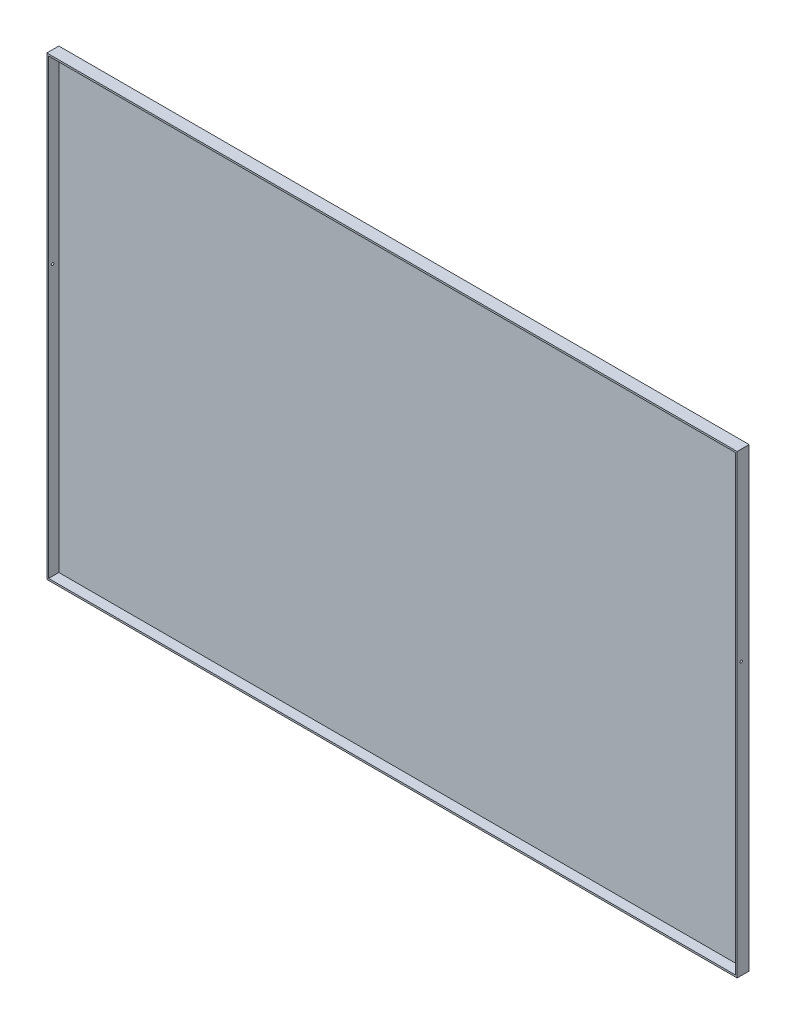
ISO-10303-21;
HEADER;
FILE_DESCRIPTION(('STEP AP214'),'2;1');
FILE_NAME('part.step','',(''),(''),'','','');
FILE_SCHEMA(('AUTOMOTIVE_DESIGN { 1 0 10303 214 1 1 1 1 }'));
ENDSEC;
DATA;
#1=APPLICATION_CONTEXT('core data for automotive mechanical design processes');
#2=APPLICATION_PROTOCOL_DEFINITION('international standard','automotive_design',2000,#1);
#3=PRODUCT_CONTEXT('',#1,'mechanical');
#4=PRODUCT('Part','Part','',(#3));
#5=PRODUCT_RELATED_PRODUCT_CATEGORY('part','',(#4));
#6=PRODUCT_DEFINITION_FORMATION('','',#4);
#7=PRODUCT_DEFINITION_CONTEXT('part definition',#1,'design');
#8=PRODUCT_DEFINITION('design','',#6,#7);
#9=PRODUCT_DEFINITION_SHAPE('','',#8);
#10=(LENGTH_UNIT() NAMED_UNIT(*) SI_UNIT(.MILLI.,.METRE.));
#11=(NAMED_UNIT(*) PLANE_ANGLE_UNIT() SI_UNIT($,.RADIAN.));
#12=(NAMED_UNIT(*) SI_UNIT($,.STERADIAN.) SOLID_ANGLE_UNIT());
#13=UNCERTAINTY_MEASURE_WITH_UNIT(LENGTH_MEASURE(1.E-05),#10,'distance_accuracy_value','');
#14=(GEOMETRIC_REPRESENTATION_CONTEXT(3) GLOBAL_UNCERTAINTY_ASSIGNED_CONTEXT((#13)) GLOBAL_UNIT_ASSIGNED_CONTEXT((#10,
#11,#12)) REPRESENTATION_CONTEXT('',''));
#15=CARTESIAN_POINT('',(0.,0.,0.));
#16=DIRECTION('',(0.,0.,1.));
#17=DIRECTION('',(1.,0.,0.));
#18=AXIS2_PLACEMENT_3D('',#15,#16,#17);
#19=CARTESIAN_POINT('',(-863.,-570.,30.));
#20=DIRECTION('',(1.,0.,0.));
#21=DIRECTION('',(0.,0.,-1.));
#22=AXIS2_PLACEMENT_3D('',#19,#20,#21);
#23=PLANE('',#22);
#24=CARTESIAN_POINT('',(-863.,110.,20.));
#25=DIRECTION('',(-1.,0.,0.));
#26=DIRECTION('',(0.,0.,1.));
#27=AXIS2_PLACEMENT_3D('',#24,#25,#26);
#28=CIRCLE('',#27,3.);
#29=CARTESIAN_POINT('',(-863.,110.,23.));
#30=VERTEX_POINT('',#29);
#31=EDGE_CURVE('E192',#30,#30,#28,.T.);
#32=ORIENTED_EDGE('',*,*,#31,.F.);
#33=EDGE_LOOP('',(#32));
#34=FACE_BOUND('',#33,.T.);
#35=DIRECTION('',(0.,-1.,0.));
#36=VECTOR('',#35,1.);
#37=CARTESIAN_POINT('',(-863.,-570.,0.));
#38=LINE('',#37,#36);
#39=CARTESIAN_POINT('',(-863.,570.,0.));
#40=VERTEX_POINT('',#39);
#41=CARTESIAN_POINT('',(-863.,-570.,0.));
#42=VERTEX_POINT('',#41);
#43=EDGE_CURVE('E148',#40,#42,#38,.T.);
#44=ORIENTED_EDGE('',*,*,#43,.T.);
#45=DIRECTION('',(0.,0.,-1.));
#46=VECTOR('',#45,1.);
#47=CARTESIAN_POINT('',(-863.,-570.,30.));
#48=LINE('',#47,#46);
#49=CARTESIAN_POINT('',(-863.,-570.,30.));
#50=VERTEX_POINT('',#49);
#51=EDGE_CURVE('E11',#50,#42,#48,.T.);
#52=ORIENTED_EDGE('',*,*,#51,.F.);
#53=DIRECTION('',(0.,-1.,0.));
#54=VECTOR('',#53,1.);
#55=CARTESIAN_POINT('',(-863.,-570.,30.));
#56=LINE('',#55,#54);
#57=CARTESIAN_POINT('',(-863.,570.,30.));
#58=VERTEX_POINT('',#57);
#59=EDGE_CURVE('E141',#58,#50,#56,.T.);
#60=ORIENTED_EDGE('',*,*,#59,.F.);
#61=DIRECTION('',(0.,0.,-1.));
#62=VECTOR('',#61,1.);
#63=CARTESIAN_POINT('',(-863.,570.,30.));
#64=LINE('',#63,#62);
#65=EDGE_CURVE('E147',#58,#40,#64,.T.);
#66=ORIENTED_EDGE('',*,*,#65,.T.);
#67=EDGE_LOOP('',(#44,#52,#60,#66));
#68=FACE_BOUND('',#67,.T.);
#69=ADVANCED_FACE('F33',(#34,#68),#23,.F.);
#70=CARTESIAN_POINT('',(863.,-570.,30.));
#71=DIRECTION('',(0.,1.,0.));
#72=DIRECTION('',(-1.,0.,0.));
#73=AXIS2_PLACEMENT_3D('',#70,#71,#72);
#74=PLANE('',#73);
#75=DIRECTION('',(1.,0.,0.));
#76=VECTOR('',#75,1.);
#77=CARTESIAN_POINT('',(863.,-570.,0.));
#78=LINE('',#77,#76);
#79=CARTESIAN_POINT('',(863.,-570.,0.));
#80=VERTEX_POINT('',#79);
#81=EDGE_CURVE('E151',#42,#80,#78,.T.);
#82=ORIENTED_EDGE('',*,*,#81,.T.);
#83=DIRECTION('',(0.,0.,-1.));
#84=VECTOR('',#83,1.);
#85=CARTESIAN_POINT('',(863.,-570.,30.));
#86=LINE('',#85,#84);
#87=CARTESIAN_POINT('',(863.,-570.,30.));
#88=VERTEX_POINT('',#87);
#89=EDGE_CURVE('E41',#88,#80,#86,.T.);
#90=ORIENTED_EDGE('',*,*,#89,.F.);
#91=DIRECTION('',(1.,0.,0.));
#92=VECTOR('',#91,1.);
#93=CARTESIAN_POINT('',(863.,-570.,30.));
#94=LINE('',#93,#92);
#95=EDGE_CURVE('E85',#50,#88,#94,.T.);
#96=ORIENTED_EDGE('',*,*,#95,.F.);
#97=ORIENTED_EDGE('',*,*,#51,.T.);
#98=EDGE_LOOP('',(#82,#90,#96,#97));
#99=FACE_BOUND('',#98,.T.);
#100=ADVANCED_FACE('F181',(#99),#74,.F.);
#101=CARTESIAN_POINT('',(863.,-570.,30.));
#102=DIRECTION('',(-1.,0.,0.));
#103=DIRECTION('',(0.,0.,1.));
#104=AXIS2_PLACEMENT_3D('',#101,#102,#103);
#105=PLANE('',#104);
#106=CARTESIAN_POINT('',(863.,110.,20.));
#107=DIRECTION('',(-1.,0.,0.));
#108=DIRECTION('',(0.,0.,1.));
#109=AXIS2_PLACEMENT_3D('',#106,#107,#108);
#110=CIRCLE('',#109,3.);
#111=CARTESIAN_POINT('',(863.,110.,23.));
#112=VERTEX_POINT('',#111);
#113=EDGE_CURVE('E194',#112,#112,#110,.T.);
#114=ORIENTED_EDGE('',*,*,#113,.T.);
#115=EDGE_LOOP('',(#114));
#116=FACE_BOUND('',#115,.T.);
#117=DIRECTION('',(0.,1.,0.));
#118=VECTOR('',#117,1.);
#119=CARTESIAN_POINT('',(863.,-570.,0.));
#120=LINE('',#119,#118);
#121=CARTESIAN_POINT('',(863.,570.,0.));
#122=VERTEX_POINT('',#121);
#123=EDGE_CURVE('E153',#80,#122,#120,.T.);
#124=ORIENTED_EDGE('',*,*,#123,.T.);
#125=DIRECTION('',(0.,0.,-1.));
#126=VECTOR('',#125,1.);
#127=CARTESIAN_POINT('',(863.,570.,30.));
#128=LINE('',#127,#126);
#129=CARTESIAN_POINT('',(863.,570.,30.));
#130=VERTEX_POINT('',#129);
#131=EDGE_CURVE('E157',#130,#122,#128,.T.);
#132=ORIENTED_EDGE('',*,*,#131,.F.);
#133=DIRECTION('',(0.,1.,0.));
#134=VECTOR('',#133,1.);
#135=CARTESIAN_POINT('',(863.,-570.,30.));
#136=LINE('',#135,#134);
#137=EDGE_CURVE('E144',#88,#130,#136,.T.);
#138=ORIENTED_EDGE('',*,*,#137,.F.);
#139=ORIENTED_EDGE('',*,*,#89,.T.);
#140=EDGE_LOOP('',(#124,#132,#138,#139));
#141=FACE_BOUND('',#140,.T.);
#142=ADVANCED_FACE('F163',(#116,#141),#105,.F.);
#143=CARTESIAN_POINT('',(863.,570.,30.));
#144=DIRECTION('',(0.,-1.,0.));
#145=DIRECTION('',(1.,0.,0.));
#146=AXIS2_PLACEMENT_3D('',#143,#144,#145);
#147=PLANE('',#146);
#148=DIRECTION('',(-1.,0.,0.));
#149=VECTOR('',#148,1.);
#150=CARTESIAN_POINT('',(863.,570.,0.));
#151=LINE('',#150,#149);
#152=EDGE_CURVE('E78',#122,#40,#151,.T.);
#153=ORIENTED_EDGE('',*,*,#152,.T.);
#154=ORIENTED_EDGE('',*,*,#65,.F.);
#155=DIRECTION('',(-1.,0.,0.));
#156=VECTOR('',#155,1.);
#157=CARTESIAN_POINT('',(863.,570.,30.));
#158=LINE('',#157,#156);
#159=EDGE_CURVE('E57',#130,#58,#158,.T.);
#160=ORIENTED_EDGE('',*,*,#159,.F.);
#161=ORIENTED_EDGE('',*,*,#131,.T.);
#162=EDGE_LOOP('',(#153,#154,#160,#161));
#163=FACE_BOUND('',#162,.T.);
#164=ADVANCED_FACE('F171',(#163),#147,.F.);
#165=CARTESIAN_POINT('',(0.,0.,30.));
#166=DIRECTION('',(0.,0.,1.));
#167=DIRECTION('',(1.,0.,0.));
#168=AXIS2_PLACEMENT_3D('',#165,#166,#167);
#169=PLANE('',#168);
#170=DIRECTION('',(0.,-1.,0.));
#171=VECTOR('',#170,1.);
#172=CARTESIAN_POINT('',(-858.6,-570.,30.));
#173=LINE('',#172,#171);
#174=CARTESIAN_POINT('',(-858.6,565.6,30.));
#175=VERTEX_POINT('',#174);
#176=CARTESIAN_POINT('',(-858.6,-565.6,30.));
#177=VERTEX_POINT('',#176);
#178=EDGE_CURVE('E130',#175,#177,#173,.T.);
#179=ORIENTED_EDGE('',*,*,#178,.F.);
#180=DIRECTION('',(-1.,0.,0.));
#181=VECTOR('',#180,1.);
#182=CARTESIAN_POINT('',(863.,565.6,30.));
#183=LINE('',#182,#181);
#184=CARTESIAN_POINT('',(858.6,565.6,30.));
#185=VERTEX_POINT('',#184);
#186=EDGE_CURVE('E139',#185,#175,#183,.T.);
#187=ORIENTED_EDGE('',*,*,#186,.F.);
#188=DIRECTION('',(0.,1.,0.));
#189=VECTOR('',#188,1.);
#190=CARTESIAN_POINT('',(858.6,-570.,30.));
#191=LINE('',#190,#189);
#192=CARTESIAN_POINT('',(858.6,-565.6,30.));
#193=VERTEX_POINT('',#192);
#194=EDGE_CURVE('E137',#193,#185,#191,.T.);
#195=ORIENTED_EDGE('',*,*,#194,.F.);
#196=DIRECTION('',(1.,0.,0.));
#197=VECTOR('',#196,1.);
#198=CARTESIAN_POINT('',(863.,-565.6,30.));
#199=LINE('',#198,#197);
#200=EDGE_CURVE('E122',#177,#193,#199,.T.);
#201=ORIENTED_EDGE('',*,*,#200,.F.);
#202=EDGE_LOOP('',(#179,#187,#195,#201));
#203=FACE_BOUND('',#202,.T.);
#204=ORIENTED_EDGE('',*,*,#59,.T.);
#205=ORIENTED_EDGE('',*,*,#95,.T.);
#206=ORIENTED_EDGE('',*,*,#137,.T.);
#207=ORIENTED_EDGE('',*,*,#159,.T.);
#208=EDGE_LOOP('',(#204,#205,#206,#207));
#209=FACE_BOUND('',#208,.T.);
#210=ADVANCED_FACE('F173',(#203,#209),#169,.T.);
#211=CARTESIAN_POINT('',(0.,0.,0.));
#212=DIRECTION('',(0.,0.,1.));
#213=DIRECTION('',(1.,0.,0.));
#214=AXIS2_PLACEMENT_3D('',#211,#212,#213);
#215=PLANE('',#214);
#216=ORIENTED_EDGE('',*,*,#43,.F.);
#217=ORIENTED_EDGE('',*,*,#152,.F.);
#218=ORIENTED_EDGE('',*,*,#123,.F.);
#219=ORIENTED_EDGE('',*,*,#81,.F.);
#220=EDGE_LOOP('',(#216,#217,#218,#219));
#221=FACE_BOUND('',#220,.T.);
#222=ADVANCED_FACE('F167',(#221),#215,.F.);
#223=CARTESIAN_POINT('',(-858.6,-570.,30.));
#224=DIRECTION('',(1.,0.,0.));
#225=DIRECTION('',(0.,0.,-1.));
#226=AXIS2_PLACEMENT_3D('',#223,#224,#225);
#227=PLANE('',#226);
#228=CARTESIAN_POINT('',(-858.6,110.,20.));
#229=DIRECTION('',(1.,0.,0.));
#230=DIRECTION('',(0.,0.,-1.));
#231=AXIS2_PLACEMENT_3D('',#228,#229,#230);
#232=CIRCLE('',#231,3.);
#233=CARTESIAN_POINT('',(-858.6,110.,17.));
#234=VERTEX_POINT('',#233);
#235=EDGE_CURVE('E199',#234,#234,#232,.T.);
#236=ORIENTED_EDGE('',*,*,#235,.F.);
#237=EDGE_LOOP('',(#236));
#238=FACE_BOUND('',#237,.T.);
#239=DIRECTION('',(0.,-1.,0.));
#240=VECTOR('',#239,1.);
#241=CARTESIAN_POINT('',(-858.6,-570.,4.4));
#242=LINE('',#241,#240);
#243=CARTESIAN_POINT('',(-858.6,565.6,4.4));
#244=VERTEX_POINT('',#243);
#245=CARTESIAN_POINT('',(-858.6,-565.6,4.4));
#246=VERTEX_POINT('',#245);
#247=EDGE_CURVE('E113',#244,#246,#242,.T.);
#248=ORIENTED_EDGE('',*,*,#247,.F.);
#249=DIRECTION('',(0.,0.,-1.));
#250=VECTOR('',#249,1.);
#251=CARTESIAN_POINT('',(-858.6,565.6,30.));
#252=LINE('',#251,#250);
#253=EDGE_CURVE('E133',#175,#244,#252,.T.);
#254=ORIENTED_EDGE('',*,*,#253,.F.);
#255=ORIENTED_EDGE('',*,*,#178,.T.);
#256=DIRECTION('',(0.,0.,-1.));
#257=VECTOR('',#256,1.);
#258=CARTESIAN_POINT('',(-858.6,-565.6,30.));
#259=LINE('',#258,#257);
#260=EDGE_CURVE('E125',#177,#246,#259,.T.);
#261=ORIENTED_EDGE('',*,*,#260,.T.);
#262=EDGE_LOOP('',(#248,#254,#255,#261));
#263=FACE_BOUND('',#262,.T.);
#264=ADVANCED_FACE('F210',(#238,#263),#227,.T.);
#265=CARTESIAN_POINT('',(863.,-565.6,30.));
#266=DIRECTION('',(0.,1.,0.));
#267=DIRECTION('',(-1.,0.,0.));
#268=AXIS2_PLACEMENT_3D('',#265,#266,#267);
#269=PLANE('',#268);
#270=DIRECTION('',(1.,0.,0.));
#271=VECTOR('',#270,1.);
#272=CARTESIAN_POINT('',(863.,-565.6,4.4));
#273=LINE('',#272,#271);
#274=CARTESIAN_POINT('',(858.6,-565.6,4.4));
#275=VERTEX_POINT('',#274);
#276=EDGE_CURVE('E107',#246,#275,#273,.T.);
#277=ORIENTED_EDGE('',*,*,#276,.F.);
#278=ORIENTED_EDGE('',*,*,#260,.F.);
#279=ORIENTED_EDGE('',*,*,#200,.T.);
#280=DIRECTION('',(0.,0.,-1.));
#281=VECTOR('',#280,1.);
#282=CARTESIAN_POINT('',(858.6,-565.6,30.));
#283=LINE('',#282,#281);
#284=EDGE_CURVE('E119',#193,#275,#283,.T.);
#285=ORIENTED_EDGE('',*,*,#284,.T.);
#286=EDGE_LOOP('',(#277,#278,#279,#285));
#287=FACE_BOUND('',#286,.T.);
#288=ADVANCED_FACE('F120',(#287),#269,.T.);
#289=CARTESIAN_POINT('',(858.6,-570.,30.));
#290=DIRECTION('',(-1.,0.,0.));
#291=DIRECTION('',(0.,0.,1.));
#292=AXIS2_PLACEMENT_3D('',#289,#290,#291);
#293=PLANE('',#292);
#294=CARTESIAN_POINT('',(858.6,110.,20.));
#295=DIRECTION('',(-1.,0.,0.));
#296=DIRECTION('',(0.,0.,1.));
#297=AXIS2_PLACEMENT_3D('',#294,#295,#296);
#298=CIRCLE('',#297,3.);
#299=CARTESIAN_POINT('',(858.6,110.,23.));
#300=VERTEX_POINT('',#299);
#301=EDGE_CURVE('E36',#300,#300,#298,.T.);
#302=ORIENTED_EDGE('',*,*,#301,.F.);
#303=EDGE_LOOP('',(#302));
#304=FACE_BOUND('',#303,.T.);
#305=DIRECTION('',(0.,1.,0.));
#306=VECTOR('',#305,1.);
#307=CARTESIAN_POINT('',(858.6,-570.,4.4));
#308=LINE('',#307,#306);
#309=CARTESIAN_POINT('',(858.6,565.6,4.4));
#310=VERTEX_POINT('',#309);
#311=EDGE_CURVE('E111',#275,#310,#308,.T.);
#312=ORIENTED_EDGE('',*,*,#311,.F.);
#313=ORIENTED_EDGE('',*,*,#284,.F.);
#314=ORIENTED_EDGE('',*,*,#194,.T.);
#315=DIRECTION('',(0.,0.,-1.));
#316=VECTOR('',#315,1.);
#317=CARTESIAN_POINT('',(858.6,565.6,30.));
#318=LINE('',#317,#316);
#319=EDGE_CURVE('E48',#185,#310,#318,.T.);
#320=ORIENTED_EDGE('',*,*,#319,.T.);
#321=EDGE_LOOP('',(#312,#313,#314,#320));
#322=FACE_BOUND('',#321,.T.);
#323=ADVANCED_FACE('F127',(#304,#322),#293,.T.);
#324=CARTESIAN_POINT('',(863.,565.6,30.));
#325=DIRECTION('',(0.,-1.,0.));
#326=DIRECTION('',(1.,0.,0.));
#327=AXIS2_PLACEMENT_3D('',#324,#325,#326);
#328=PLANE('',#327);
#329=DIRECTION('',(-1.,0.,0.));
#330=VECTOR('',#329,1.);
#331=CARTESIAN_POINT('',(863.,565.6,4.4));
#332=LINE('',#331,#330);
#333=EDGE_CURVE('E128',#310,#244,#332,.T.);
#334=ORIENTED_EDGE('',*,*,#333,.F.);
#335=ORIENTED_EDGE('',*,*,#319,.F.);
#336=ORIENTED_EDGE('',*,*,#186,.T.);
#337=ORIENTED_EDGE('',*,*,#253,.T.);
#338=EDGE_LOOP('',(#334,#335,#336,#337));
#339=FACE_BOUND('',#338,.T.);
#340=ADVANCED_FACE('F206',(#339),#328,.T.);
#341=CARTESIAN_POINT('',(0.,0.,4.4));
#342=DIRECTION('',(0.,0.,1.));
#343=DIRECTION('',(1.,0.,0.));
#344=AXIS2_PLACEMENT_3D('',#341,#342,#343);
#345=PLANE('',#344);
#346=ORIENTED_EDGE('',*,*,#247,.T.);
#347=ORIENTED_EDGE('',*,*,#276,.T.);
#348=ORIENTED_EDGE('',*,*,#311,.T.);
#349=ORIENTED_EDGE('',*,*,#333,.T.);
#350=EDGE_LOOP('',(#346,#347,#348,#349));
#351=FACE_BOUND('',#350,.T.);
#352=ADVANCED_FACE('F109',(#351),#345,.T.);
#353=CARTESIAN_POINT('',(863.,110.,20.));
#354=DIRECTION('',(-1.,0.,0.));
#355=DIRECTION('',(0.,0.,1.));
#356=AXIS2_PLACEMENT_3D('',#353,#354,#355);
#357=CYLINDRICAL_SURFACE('',#356,3.);
#358=ORIENTED_EDGE('',*,*,#301,.T.);
#359=EDGE_LOOP('',(#358));
#360=FACE_BOUND('',#359,.T.);
#361=ORIENTED_EDGE('',*,*,#113,.F.);
#362=EDGE_LOOP('',(#361));
#363=FACE_BOUND('',#362,.T.);
#364=ADVANCED_FACE('F221',(#360,#363),#357,.F.);
#365=ORIENTED_EDGE('',*,*,#235,.T.);
#366=EDGE_LOOP('',(#365));
#367=FACE_BOUND('',#366,.T.);
#368=ORIENTED_EDGE('',*,*,#31,.T.);
#369=EDGE_LOOP('',(#368));
#370=FACE_BOUND('',#369,.T.);
#371=ADVANCED_FACE('F232',(#367,#370),#357,.F.);
#372=CLOSED_SHELL('',(#69,#100,#142,#164,#210,#222,#264,#288,#323,#340,#352,#364,#371));
#373=MANIFOLD_SOLID_BREP('B2',#372);
#374=ADVANCED_BREP_SHAPE_REPRESENTATION('',(#18,#373),#14);
#375=SHAPE_DEFINITION_REPRESENTATION(#9,#374);
ENDSEC;
END-ISO-10303-21;
